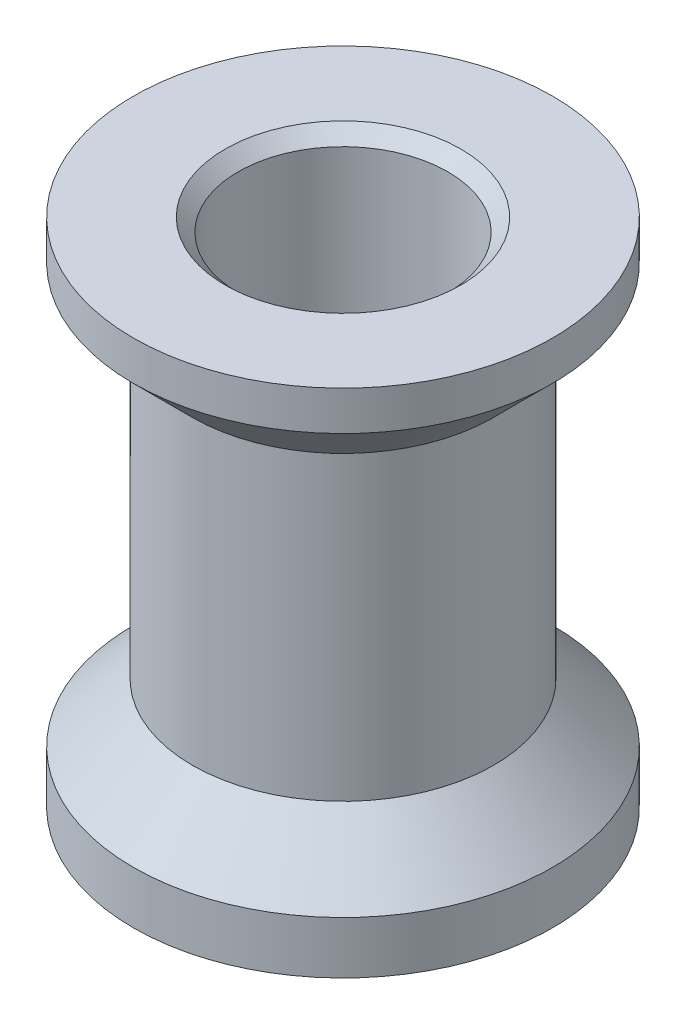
from build123d import *

# Parameters (mm, degrees)
CHAMFER_1_SIZE = 0.5


with BuildPart() as part:
    # Sketch 1 → Revolve 1 (revolve)
    with BuildSketch(Plane(origin=(0, 0, 0), x_dir=(0, 0, -1), z_dir=(1, 0, 0)), mode=Mode.PRIVATE) as revolve_1_sk:
        Polygon((4, 9.75), (8, 9.75), (8, 8.25), (5.75, 6), (5.75, -5.5), (8, -7.75), (8, -9.75), (4, -9.75), align=None)
    revolve(revolve_1_sk.sketch.rotate(Axis((0, 9.75, 0), (0, -1, 0)), 180), axis=Axis((0, 9.75, 0), (0, -1, 0)))

    # Chamfer 1
    chamfer_1_edges = [part.edges().sort_by_distance(p)[0] for p in [
        (0, 9.75, -4),
    ]]
    chamfer(chamfer_1_edges, length=CHAMFER_1_SIZE)


solid = part.part
